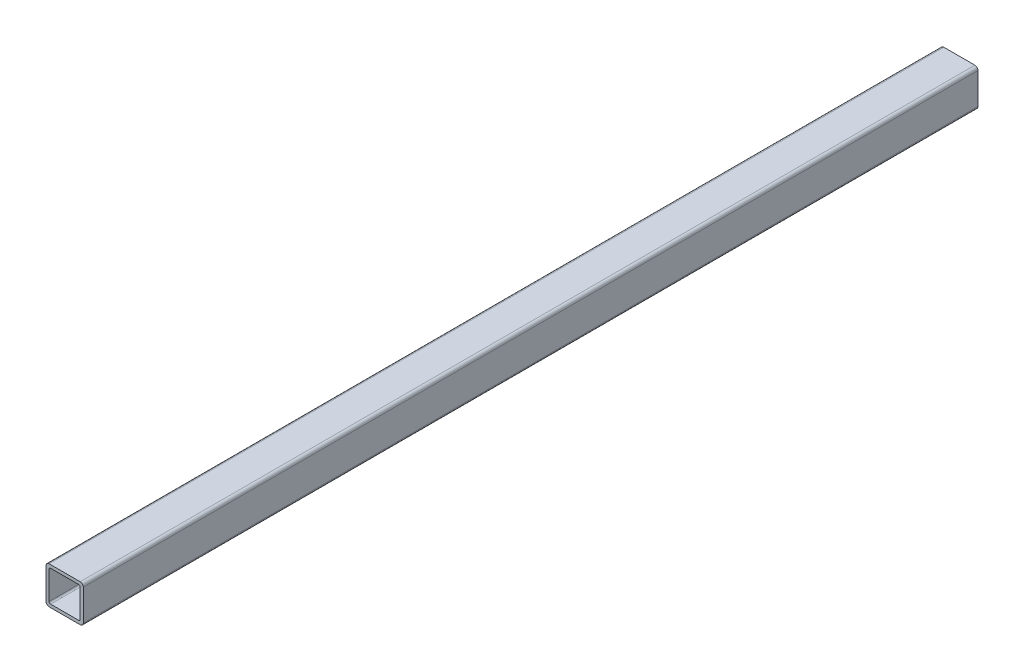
from build123d import *

# Parameters (mm, degrees)
BOSS_EXTRUDE1_DEPTH = 457.2


with BuildPart() as part:
    # Sketch1 → Boss-Extrude1 (new, symmetric)
    with BuildSketch(Plane.XY):
        with BuildLine():
            Line((-15.875, 19.05), (15.875, 19.05))
            ThreePointArc((15.875, 19.05), (18.12006403, 18.12006403), (19.05, 15.875))
            Line((19.05, 15.875), (19.05, -15.875))
            ThreePointArc((19.05, -15.875), (18.12006403, -18.12006403), (15.875, -19.05))
            Line((15.875, -19.05), (-15.875, -19.05))
            ThreePointArc((-15.875, -19.05), (-18.12006403, -18.12006403), (-19.05, -15.875))
            Line((-19.05, -15.875), (-19.05, 15.875))
            ThreePointArc((-19.05, 15.875), (-18.12006403, 18.12006403), (-15.875, 19.05))
        make_face()
        with BuildLine():
            Line((-14.2875, 15.875), (14.2875, 15.875))
            ThreePointArc((14.2875, 15.875), (15.410032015, 15.410032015), (15.875, 14.2875))
            Line((15.875, 14.2875), (15.875, -14.2875))
            ThreePointArc((15.875, -14.2875), (15.410032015, -15.410032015), (14.2875, -15.875))
            Line((14.2875, -15.875), (-14.2875, -15.875))
            ThreePointArc((-14.2875, -15.875), (-15.410032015, -15.410032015), (-15.875, -14.2875))
            Line((-15.875, -14.2875), (-15.875, 14.2875))
            ThreePointArc((-15.875, 14.2875), (-15.410032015, 15.410032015), (-14.2875, 15.875))
        make_face(mode=Mode.SUBTRACT)
    extrude(amount=BOSS_EXTRUDE1_DEPTH, both=True)


solid = part.part
